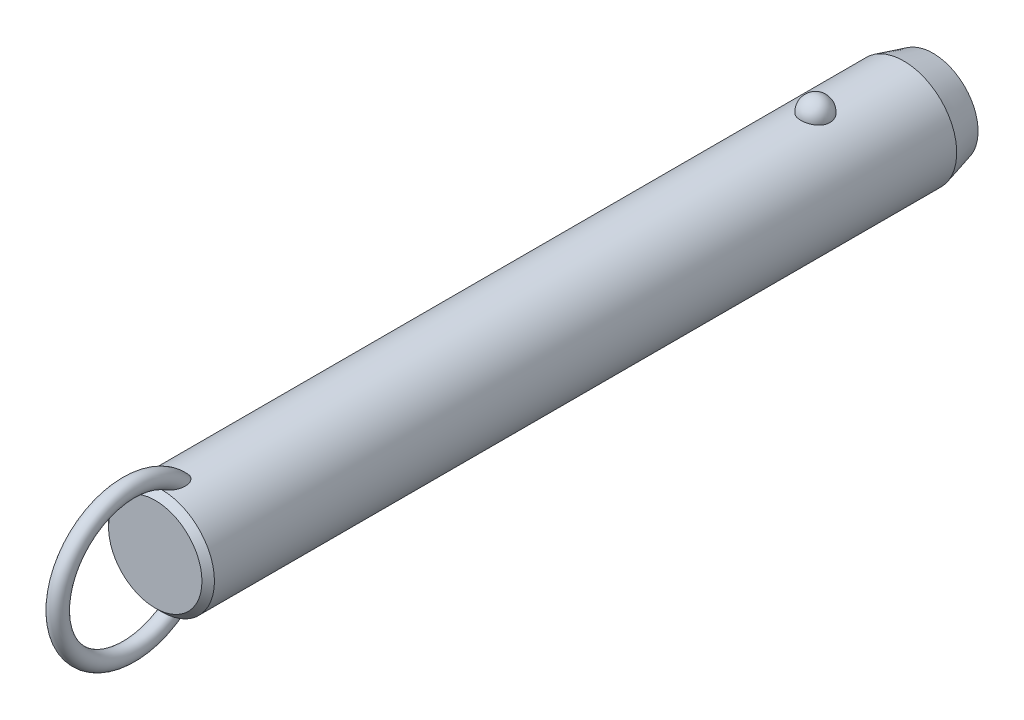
ISO-10303-21;
HEADER;
FILE_DESCRIPTION(('STEP AP214'),'2;1');
FILE_NAME('part.step','',(''),(''),'','','');
FILE_SCHEMA(('AUTOMOTIVE_DESIGN { 1 0 10303 214 1 1 1 1 }'));
ENDSEC;
DATA;
#1=APPLICATION_CONTEXT('core data for automotive mechanical design processes');
#2=APPLICATION_PROTOCOL_DEFINITION('international standard','automotive_design',2000,#1);
#3=PRODUCT_CONTEXT('',#1,'mechanical');
#4=PRODUCT('Part','Part','',(#3));
#5=PRODUCT_RELATED_PRODUCT_CATEGORY('part','',(#4));
#6=PRODUCT_DEFINITION_FORMATION('','',#4);
#7=PRODUCT_DEFINITION_CONTEXT('part definition',#1,'design');
#8=PRODUCT_DEFINITION('design','',#6,#7);
#9=PRODUCT_DEFINITION_SHAPE('','',#8);
#10=(LENGTH_UNIT() NAMED_UNIT(*) SI_UNIT(.MILLI.,.METRE.));
#11=(NAMED_UNIT(*) PLANE_ANGLE_UNIT() SI_UNIT($,.RADIAN.));
#12=(NAMED_UNIT(*) SI_UNIT($,.STERADIAN.) SOLID_ANGLE_UNIT());
#13=UNCERTAINTY_MEASURE_WITH_UNIT(LENGTH_MEASURE(1.E-05),#10,'distance_accuracy_value','');
#14=(GEOMETRIC_REPRESENTATION_CONTEXT(3) GLOBAL_UNCERTAINTY_ASSIGNED_CONTEXT((#13)) GLOBAL_UNIT_ASSIGNED_CONTEXT((#10,
#11,#12)) REPRESENTATION_CONTEXT('',''));
#15=CARTESIAN_POINT('',(0.,0.,0.));
#16=DIRECTION('',(0.,0.,1.));
#17=DIRECTION('',(1.,0.,0.));
#18=AXIS2_PLACEMENT_3D('',#15,#16,#17);
#19=CARTESIAN_POINT('',(0.,0.,142.2));
#20=DIRECTION('',(0.,0.,-1.));
#21=DIRECTION('',(-1.,0.,0.));
#22=AXIS2_PLACEMENT_3D('',#19,#20,#21);
#23=CYLINDRICAL_SURFACE('',#22,12.7);
#24=CARTESIAN_POINT('',(3.46661256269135,12.2177165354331,-3.5));
#25=CARTESIAN_POINT('',(3.4666090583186,12.2177194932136,-3.30432790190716));
#26=CARTESIAN_POINT('',(3.45063567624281,12.2222841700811,-3.10861112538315));
#27=CARTESIAN_POINT('',(3.38712451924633,12.2400345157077,-2.72271899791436));
#28=CARTESIAN_POINT('',(3.33957415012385,12.2532236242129,-2.53254588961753));
#29=CARTESIAN_POINT('',(3.2141234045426,12.286724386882,-2.16324948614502));
#30=CARTESIAN_POINT('',(3.13623639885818,12.3070329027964,-1.98412136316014));
#31=CARTESIAN_POINT('',(2.95205930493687,12.3525018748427,-1.64180592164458));
#32=CARTESIAN_POINT('',(2.84577003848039,12.3776621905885,-1.47861814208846));
#33=CARTESIAN_POINT('',(2.60688050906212,12.4301712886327,-1.17190583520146));
#34=CARTESIAN_POINT('',(2.47415697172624,12.4575299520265,-1.02847897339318));
#35=CARTESIAN_POINT('',(2.18615174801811,12.5112810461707,-0.766177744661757));
#36=CARTESIAN_POINT('',(2.03087002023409,12.5376734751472,-0.647303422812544));
#37=CARTESIAN_POINT('',(1.70237334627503,12.5864761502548,-0.437732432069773));
#38=CARTESIAN_POINT('',(1.52920948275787,12.6088972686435,-0.34695830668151));
#39=CARTESIAN_POINT('',(1.16944170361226,12.6473352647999,-0.195750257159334));
#40=CARTESIAN_POINT('',(0.982839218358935,12.663352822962,-0.135313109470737));
#41=CARTESIAN_POINT('',(0.604961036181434,12.6869706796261,-0.0473241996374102));
#42=CARTESIAN_POINT('',(0.413823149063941,12.6947125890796,-0.0192185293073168));
#43=CARTESIAN_POINT('',(0.0293827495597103,12.7014203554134,0.00517254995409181));
#44=CARTESIAN_POINT('',(-0.163919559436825,12.7003870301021,0.00146092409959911));
#45=CARTESIAN_POINT('',(-0.544374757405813,12.689735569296,-0.0373939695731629));
#46=CARTESIAN_POINT('',(-0.731575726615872,12.6802364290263,-0.0721015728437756));
#47=CARTESIAN_POINT('',(-1.09733277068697,12.6538333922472,-0.171364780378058));
#48=CARTESIAN_POINT('',(-1.27588869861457,12.6369293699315,-0.23592089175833));
#49=CARTESIAN_POINT('',(-1.6204698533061,12.5973946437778,-0.393548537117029));
#50=CARTESIAN_POINT('',(-1.78641865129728,12.5747321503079,-0.48677898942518));
#51=CARTESIAN_POINT('',(-2.10030671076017,12.5261316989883,-0.699110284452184));
#52=CARTESIAN_POINT('',(-2.24824419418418,12.5001934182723,-0.818213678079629));
#53=CARTESIAN_POINT('',(-2.52491489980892,12.4472906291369,-1.08157124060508));
#54=CARTESIAN_POINT('',(-2.65324222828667,12.4203160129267,-1.22624992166));
#55=CARTESIAN_POINT('',(-2.88410007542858,12.3687509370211,-1.53528325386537));
#56=CARTESIAN_POINT('',(-2.98662883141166,12.3441606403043,-1.69963924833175));
#57=CARTESIAN_POINT('',(-3.16432417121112,12.2998199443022,-2.04548497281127));
#58=CARTESIAN_POINT('',(-3.23917525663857,12.2801261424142,-2.22714424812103));
#59=CARTESIAN_POINT('',(-3.35800573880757,12.248167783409,-2.6009138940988));
#60=CARTESIAN_POINT('',(-3.4019860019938,12.2359030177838,-2.79302397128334));
#61=CARTESIAN_POINT('',(-3.45784812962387,12.2202347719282,-3.18140279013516));
#62=CARTESIAN_POINT('',(-3.46986123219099,12.2167950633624,-3.37765118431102));
#63=CARTESIAN_POINT('',(-3.46186273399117,12.2190638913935,-3.76943689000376));
#64=CARTESIAN_POINT('',(-3.44185196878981,12.2247721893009,-3.96497421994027));
#65=CARTESIAN_POINT('',(-3.37048652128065,12.2446381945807,-4.34881728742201));
#66=CARTESIAN_POINT('',(-3.31928253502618,12.2587552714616,-4.53715319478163));
#67=CARTESIAN_POINT('',(-3.18693461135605,12.2938237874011,-4.90231727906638));
#68=CARTESIAN_POINT('',(-3.1057895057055,12.3147754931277,-5.07914500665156));
#69=CARTESIAN_POINT('',(-2.91506431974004,12.3613125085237,-5.4173205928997));
#70=CARTESIAN_POINT('',(-2.80533587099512,12.3869217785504,-5.57858147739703));
#71=CARTESIAN_POINT('',(-2.560414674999,12.4398525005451,-5.88013283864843));
#72=CARTESIAN_POINT('',(-2.42522099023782,12.4671740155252,-6.02042254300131));
#73=CARTESIAN_POINT('',(-2.1323357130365,12.5205965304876,-6.27662798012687));
#74=CARTESIAN_POINT('',(-1.97456596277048,12.5466928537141,-6.39245542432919));
#75=CARTESIAN_POINT('',(-1.64115839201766,12.5946384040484,-6.59583547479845));
#76=CARTESIAN_POINT('',(-1.46552179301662,12.6164879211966,-6.68339001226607));
#77=CARTESIAN_POINT('',(-1.10356050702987,12.6532533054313,-6.82682153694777));
#78=CARTESIAN_POINT('',(-0.917391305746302,12.6682500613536,-6.88306988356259));
#79=CARTESIAN_POINT('',(-0.537836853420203,12.6900288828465,-6.96386887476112));
#80=CARTESIAN_POINT('',(-0.344452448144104,12.6968119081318,-6.9884232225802));
#81=CARTESIAN_POINT('',(0.0402577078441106,12.7013667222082,-7.00496469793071));
#82=CARTESIAN_POINT('',(0.231556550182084,12.6993008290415,-6.99753844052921));
#83=CARTESIAN_POINT('',(0.610105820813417,12.6867505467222,-6.95166366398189));
#84=CARTESIAN_POINT('',(0.797356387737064,12.6762664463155,-6.91321620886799));
#85=CARTESIAN_POINT('',(1.16186657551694,12.6480587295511,-6.80658431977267));
#86=CARTESIAN_POINT('',(1.33915951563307,12.6303611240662,-6.73850666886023));
#87=CARTESIAN_POINT('',(1.67968518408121,12.5896027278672,-6.57450875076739));
#88=CARTESIAN_POINT('',(1.84291705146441,12.5665416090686,-6.47858678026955));
#89=CARTESIAN_POINT('',(2.15340192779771,12.5171072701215,-6.25982455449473));
#90=CARTESIAN_POINT('',(2.30037831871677,12.4906895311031,-6.13660186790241));
#91=CARTESIAN_POINT('',(2.5717412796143,12.4376567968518,-5.86739587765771));
#92=CARTESIAN_POINT('',(2.69612388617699,12.4110417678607,-5.72140858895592));
#93=CARTESIAN_POINT('',(2.92107785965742,12.360051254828,-5.40794137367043));
#94=CARTESIAN_POINT('',(3.02121329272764,12.3357209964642,-5.24014110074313));
#95=CARTESIAN_POINT('',(3.19236291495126,12.2925446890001,-4.8896986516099));
#96=CARTESIAN_POINT('',(3.26338839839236,12.2736965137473,-4.70706226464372));
#97=CARTESIAN_POINT('',(3.36788038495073,12.245404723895,-4.35469510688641));
#98=CARTESIAN_POINT('',(3.40484026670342,12.2351018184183,-4.18605935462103));
#99=CARTESIAN_POINT('',(3.45420764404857,12.2212564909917,-3.84496058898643));
#100=CARTESIAN_POINT('',(3.46661565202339,12.2177139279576,-3.67249765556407));
#101=CARTESIAN_POINT('',(3.46661256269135,12.2177165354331,-3.5));
#102=B_SPLINE_CURVE_WITH_KNOTS('',3,(#24,#25,#26,#27,#28,#29,#30,#31,#32,#33,#34,#35,#36,#37,
#38,#39,#40,#41,#42,#43,#44,#45,#46,#47,#48,#49,#50,#51,#52,#53,#54,#55,#56,#57,#58,#59,#60,#61,
#62,#63,#64,#65,#66,#67,#68,#69,#70,#71,#72,#73,#74,#75,#76,#77,#78,#79,#80,#81,#82,#83,#84,#85,
#86,#87,#88,#89,#90,#91,#92,#93,#94,#95,#96,#97,#98,#99,#100,#101),.UNSPECIFIED.,.T.,.F.,(4,2,2,
2,2,2,2,2,2,2,2,2,2,2,2,2,2,2,2,2,2,2,2,2,2,2,2,2,2,2,2,2,2,2,2,2,2,2,4),(0.,0.586396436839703,
1.17302689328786,1.7593990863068,2.34575431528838,2.93491084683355,3.52406845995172,
4.1115873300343,4.69904375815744,5.2762784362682,5.85345931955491,6.42265312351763,
6.99185659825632,7.56427334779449,8.136746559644,8.71981013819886,9.3029135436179,
9.89247258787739,10.4820150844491,11.0691335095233,11.6562366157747,12.2405256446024,
12.8248374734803,13.412244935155,13.9996740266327,14.5891883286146,15.1786623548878,
15.7609861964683,16.3432419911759,16.914863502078,17.4864654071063,18.056024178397,
18.6256177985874,19.2037609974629,19.7820055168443,20.3699810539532,20.9577282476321,
21.4746855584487,21.9916320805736),.UNSPECIFIED.);
#103=CARTESIAN_POINT('',(3.46661256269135,12.2177165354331,-3.5));
#104=VERTEX_POINT('',#103);
#105=EDGE_CURVE('E41',#104,#104,#102,.T.);
#106=ORIENTED_EDGE('',*,*,#105,.T.);
#107=EDGE_LOOP('',(#106));
#108=FACE_BOUND('',#107,.T.);
#109=CARTESIAN_POINT('',(0.,0.,153.4));
#110=DIRECTION('',(0.,0.,1.));
#111=DIRECTION('',(1.,0.,0.));
#112=AXIS2_PLACEMENT_3D('',#109,#110,#111);
#113=CIRCLE('',#112,12.7);
#114=CARTESIAN_POINT('',(12.7,0.,153.4));
#115=VERTEX_POINT('',#114);
#116=EDGE_CURVE('E10',#115,#115,#113,.F.);
#117=ORIENTED_EDGE('',*,*,#116,.T.);
#118=EDGE_LOOP('',(#117));
#119=FACE_BOUND('',#118,.T.);
#120=CARTESIAN_POINT('',(-0.548122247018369,-12.6881662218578,147.143218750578));
#121=CARTESIAN_POINT('',(-0.648865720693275,-12.6838128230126,147.177926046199));
#122=CARTESIAN_POINT('',(-0.746398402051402,-12.6783867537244,147.222042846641));
#123=CARTESIAN_POINT('',(-0.932125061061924,-12.666091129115,147.326764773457));
#124=CARTESIAN_POINT('',(-1.02030388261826,-12.6592192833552,147.387396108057));
#125=CARTESIAN_POINT('',(-1.18487740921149,-12.6448747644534,147.521847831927));
#126=CARTESIAN_POINT('',(-1.26134296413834,-12.637406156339,147.595582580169));
#127=CARTESIAN_POINT('',(-1.40231200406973,-12.6225412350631,147.753604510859));
#128=CARTESIAN_POINT('',(-1.46681470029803,-12.6151449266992,147.83789238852));
#129=CARTESIAN_POINT('',(-1.60714786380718,-12.5981718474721,148.049657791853));
#130=CARTESIAN_POINT('',(-1.67725126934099,-12.588900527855,148.180962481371));
#131=CARTESIAN_POINT('',(-1.79536591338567,-12.5725964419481,148.453247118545));
#132=CARTESIAN_POINT('',(-1.84333535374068,-12.5655679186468,148.594244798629));
#133=CARTESIAN_POINT('',(-1.93422576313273,-12.5519624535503,148.937645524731));
#134=CARTESIAN_POINT('',(-1.96788773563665,-12.5466298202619,149.142557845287));
#135=CARTESIAN_POINT('',(-1.99413993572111,-12.542463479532,149.451760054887));
#136=CARTESIAN_POINT('',(-1.99883864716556,-12.5417153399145,149.555298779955));
#137=CARTESIAN_POINT('',(-2.00078003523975,-12.5414074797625,149.76245124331));
#138=CARTESIAN_POINT('',(-1.99802449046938,-12.5418474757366,149.866064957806));
#139=CARTESIAN_POINT('',(-1.98336733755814,-12.5441750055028,150.110320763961));
#140=CARTESIAN_POINT('',(-1.96851430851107,-12.5465291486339,150.250780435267));
#141=CARTESIAN_POINT('',(-1.92707089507,-12.5529612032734,150.529960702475));
#142=CARTESIAN_POINT('',(-1.90047458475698,-12.5570399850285,150.668680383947));
#143=CARTESIAN_POINT('',(-1.83619120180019,-12.5666008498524,150.94341135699));
#144=CARTESIAN_POINT('',(-1.79850828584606,-12.57208240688,151.079423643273));
#145=CARTESIAN_POINT('',(-1.7122379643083,-12.5841228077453,151.347842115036));
#146=CARTESIAN_POINT('',(-1.66365679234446,-12.5906810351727,151.480250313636));
#147=CARTESIAN_POINT('',(-1.57804503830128,-12.6016176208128,151.68548877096));
#148=CARTESIAN_POINT('',(-1.5447725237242,-12.6057501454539,151.759914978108));
#149=CARTESIAN_POINT('',(-1.47424480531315,-12.6141930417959,151.906839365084));
#150=CARTESIAN_POINT('',(-1.43699041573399,-12.6185033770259,151.979337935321));
#151=CARTESIAN_POINT('',(-1.35825795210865,-12.6272207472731,152.121892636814));
#152=CARTESIAN_POINT('',(-1.31678520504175,-12.6316276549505,152.191951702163));
#153=CARTESIAN_POINT('',(-1.22917793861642,-12.6404532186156,152.329070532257));
#154=CARTESIAN_POINT('',(-1.18304514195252,-12.6448718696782,152.396131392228));
#155=CARTESIAN_POINT('',(-1.07246411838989,-12.6547893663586,152.543874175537));
#156=CARTESIAN_POINT('',(-1.00642239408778,-12.6602600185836,152.623384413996));
#157=CARTESIAN_POINT('',(-0.864441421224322,-12.6707460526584,152.773169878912));
#158=CARTESIAN_POINT('',(-0.78851691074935,-12.6757620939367,152.843458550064));
#159=CARTESIAN_POINT('',(-0.652215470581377,-12.6833591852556,152.948680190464));
#160=CARTESIAN_POINT('',(-0.594982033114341,-12.6861973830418,152.987624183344));
#161=CARTESIAN_POINT('',(-0.475269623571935,-12.6912445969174,153.056489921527));
#162=CARTESIAN_POINT('',(-0.41280013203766,-12.6934547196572,153.086427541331));
#163=CARTESIAN_POINT('',(-0.295749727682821,-12.6966636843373,153.129756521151));
#164=CARTESIAN_POINT('',(-0.241949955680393,-12.6978134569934,153.145218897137));
#165=CARTESIAN_POINT('',(-0.132508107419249,-12.6994261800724,153.166884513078));
#166=CARTESIAN_POINT('',(-0.0768679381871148,-12.6998898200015,153.173097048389));
#167=CARTESIAN_POINT('',(0.0347696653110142,-12.7000752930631,153.175583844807));
#168=CARTESIAN_POINT('',(0.0907676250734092,-12.6997954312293,153.171835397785));
#169=CARTESIAN_POINT('',(0.201283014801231,-12.6985255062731,153.154788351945));
#170=CARTESIAN_POINT('',(0.255799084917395,-12.6975348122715,153.141481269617));
#171=CARTESIAN_POINT('',(0.376042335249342,-12.6946091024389,153.10203792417));
#172=CARTESIAN_POINT('',(0.440950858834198,-12.6924943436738,153.073449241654));
#173=CARTESIAN_POINT('',(0.565350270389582,-12.6875639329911,153.006323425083));
#174=CARTESIAN_POINT('',(0.624828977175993,-12.6847467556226,152.967764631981));
#175=CARTESIAN_POINT('',(0.774116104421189,-12.6767252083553,152.856949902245));
#176=CARTESIAN_POINT('',(0.859449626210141,-12.6711344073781,152.778760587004));
#177=CARTESIAN_POINT('',(1.01789440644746,-12.6593922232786,152.610943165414));
#178=CARTESIAN_POINT('',(1.09096902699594,-12.653239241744,152.521282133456));
#179=CARTESIAN_POINT('',(1.22268793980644,-12.6411674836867,152.340265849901));
#180=CARTESIAN_POINT('',(1.28193986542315,-12.6352572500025,152.249345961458));
#181=CARTESIAN_POINT('',(1.39259777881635,-12.6235401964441,152.062792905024));
#182=CARTESIAN_POINT('',(1.44399707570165,-12.6177334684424,151.967155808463));
#183=CARTESIAN_POINT('',(1.53972870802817,-12.6064093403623,151.772273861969));
#184=CARTESIAN_POINT('',(1.58405262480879,-12.6008922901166,151.673024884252));
#185=CARTESIAN_POINT('',(1.66600705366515,-12.5903187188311,151.471772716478));
#186=CARTESIAN_POINT('',(1.70363651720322,-12.5852622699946,151.369769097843));
#187=CARTESIAN_POINT('',(1.7754537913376,-12.5753406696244,151.154358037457));
#188=CARTESIAN_POINT('',(1.80903453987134,-12.5705328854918,151.040745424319));
#189=CARTESIAN_POINT('',(1.86844163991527,-12.5618400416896,150.811457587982));
#190=CARTESIAN_POINT('',(1.89426665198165,-12.5579551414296,150.695782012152));
#191=CARTESIAN_POINT('',(1.93785464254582,-12.5513030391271,150.463007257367));
#192=CARTESIAN_POINT('',(1.95562640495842,-12.5485346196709,150.345909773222));
#193=CARTESIAN_POINT('',(1.98264463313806,-12.5442934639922,150.110747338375));
#194=CARTESIAN_POINT('',(1.99189298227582,-12.5428204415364,149.99268260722));
#195=CARTESIAN_POINT('',(2.00416068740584,-12.540871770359,149.680622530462));
#196=CARTESIAN_POINT('',(1.99944433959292,-12.541631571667,149.486229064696));
#197=CARTESIAN_POINT('',(1.9611375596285,-12.5476846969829,149.100309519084));
#198=CARTESIAN_POINT('',(1.92758341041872,-12.5529723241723,148.908780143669));
#199=CARTESIAN_POINT('',(1.83934342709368,-12.5661532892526,148.582272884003));
#200=CARTESIAN_POINT('',(1.79215440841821,-12.5730485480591,148.44524997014));
#201=CARTESIAN_POINT('',(1.67676242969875,-12.588958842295,148.180445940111));
#202=CARTESIAN_POINT('',(1.6085905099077,-12.597970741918,148.052651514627));
#203=CARTESIAN_POINT('',(1.46583832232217,-12.6152829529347,147.835800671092));
#204=CARTESIAN_POINT('',(1.39525727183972,-12.6233659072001,147.74410500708));
#205=CARTESIAN_POINT('',(1.23992594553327,-12.6395676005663,147.573485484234));
#206=CARTESIAN_POINT('',(1.15517932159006,-12.6476863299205,147.494558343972));
#207=CARTESIAN_POINT('',(0.971995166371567,-12.6630846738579,147.352643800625));
#208=CARTESIAN_POINT('',(0.873456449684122,-12.6703572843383,147.289784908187));
#209=CARTESIAN_POINT('',(0.6658477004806,-12.6829569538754,147.184487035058));
#210=CARTESIAN_POINT('',(0.556784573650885,-12.688285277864,147.142034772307));
#211=CARTESIAN_POINT('',(0.347338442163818,-12.6956226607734,147.084443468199));
#212=CARTESIAN_POINT('',(0.247759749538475,-12.6979816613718,147.066399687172));
#213=CARTESIAN_POINT('',(0.047021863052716,-12.7003077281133,147.048600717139));
#214=CARTESIAN_POINT('',(-0.0541350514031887,-12.7002779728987,147.048821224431));
#215=CARTESIAN_POINT('',(-0.22141402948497,-12.6982482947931,147.064363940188));
#216=CARTESIAN_POINT('',(-0.288055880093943,-12.6969033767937,147.074666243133));
#217=CARTESIAN_POINT('',(-0.419599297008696,-12.6932369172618,147.10313489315));
#218=CARTESIAN_POINT('',(-0.484501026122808,-12.6909154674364,147.121300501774));
#219=CARTESIAN_POINT('',(-0.548122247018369,-12.6881662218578,147.143218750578));
#220=B_SPLINE_CURVE_WITH_KNOTS('',3,(#120,#121,#122,#123,#124,#125,#126,#127,#128,#129,#130,
#131,#132,#133,#134,#135,#136,#137,#138,#139,#140,#141,#142,#143,#144,#145,#146,#147,#148,#149,
#150,#151,#152,#153,#154,#155,#156,#157,#158,#159,#160,#161,#162,#163,#164,#165,#166,#167,#168,
#169,#170,#171,#172,#173,#174,#175,#176,#177,#178,#179,#180,#181,#182,#183,#184,#185,#186,#187,
#188,#189,#190,#191,#192,#193,#194,#195,#196,#197,#198,#199,#200,#201,#202,#203,#204,#205,#206,
#207,#208,#209,#210,#211,#212,#213,#214,#215,#216,#217,#218,#219),.UNSPECIFIED.,.T.,.F.,(4,2,2,
2,2,2,2,2,2,2,2,2,2,2,2,2,2,2,2,2,2,2,2,2,2,2,2,2,2,2,2,2,2,2,2,2,2,2,2,2,2,2,2,2,2,2,2,2,2,4),
(0.,0.319642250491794,0.639794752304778,0.957927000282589,1.27608021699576,1.72100165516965,
2.16675988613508,2.78630021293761,3.09705782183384,3.4077412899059,3.83096358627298,
4.25439969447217,4.67767724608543,5.1007133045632,5.34550297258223,5.59024267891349,
5.83467707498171,6.07902143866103,6.38891080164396,6.6983432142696,6.90560910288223,
7.11250749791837,7.279773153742,7.44687060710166,7.6143493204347,7.78197685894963,
7.99365544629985,8.20579780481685,8.551473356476,8.89816429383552,9.22375138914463,
9.54961437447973,9.87586224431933,10.202161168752,10.5575872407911,10.9130746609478,
11.2681734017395,11.6231936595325,12.2046601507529,12.7853961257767,13.2191642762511,
13.6522938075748,13.9989174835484,14.3454519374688,14.6946768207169,15.0436740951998,
15.3457513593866,15.6474266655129,15.8493051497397,16.0511646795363),.UNSPECIFIED.);
#221=CARTESIAN_POINT('',(-0.548122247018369,-12.6881662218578,147.143218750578));
#222=VERTEX_POINT('',#221);
#223=EDGE_CURVE('E59',#222,#222,#220,.T.);
#224=ORIENTED_EDGE('',*,*,#223,.T.);
#225=EDGE_LOOP('',(#224));
#226=FACE_BOUND('',#225,.T.);
#227=CARTESIAN_POINT('',(-0.548122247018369,12.6881662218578,147.143218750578));
#228=CARTESIAN_POINT('',(-0.459436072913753,12.6919968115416,147.112673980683));
#229=CARTESIAN_POINT('',(-0.368189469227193,12.6949996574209,147.089391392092));
#230=CARTESIAN_POINT('',(-0.183024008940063,12.6990186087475,147.058406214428));
#231=CARTESIAN_POINT('',(-0.0891049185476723,12.7000345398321,147.050704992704));
#232=CARTESIAN_POINT('',(0.0987147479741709,12.6999636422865,147.051245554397));
#233=CARTESIAN_POINT('',(0.192615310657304,12.6988761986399,147.059492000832));
#234=CARTESIAN_POINT('',(0.377658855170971,12.6947211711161,147.091551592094));
#235=CARTESIAN_POINT('',(0.468801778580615,12.6916535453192,147.115365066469));
#236=CARTESIAN_POINT('',(0.645809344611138,12.6838788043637,147.17745651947));
#237=CARTESIAN_POINT('',(0.731679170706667,12.6791733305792,147.215720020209));
#238=CARTESIAN_POINT('',(0.896315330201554,12.6686004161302,147.305120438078));
#239=CARTESIAN_POINT('',(0.97508059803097,12.6627328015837,147.356259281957));
#240=CARTESIAN_POINT('',(1.12963655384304,12.6499161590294,147.47367820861));
#241=CARTESIAN_POINT('',(1.20478673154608,12.6429194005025,147.540792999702));
#242=CARTESIAN_POINT('',(1.34448241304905,12.6288282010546,147.68522507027));
#243=CARTESIAN_POINT('',(1.40902173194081,12.621733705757,147.762548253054));
#244=CARTESIAN_POINT('',(1.55208211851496,12.6050877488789,147.959247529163));
#245=CARTESIAN_POINT('',(1.62510490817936,12.5957546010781,148.082654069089));
#246=CARTESIAN_POINT('',(1.7501904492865,12.5789823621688,148.339769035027));
#247=CARTESIAN_POINT('',(1.80221377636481,12.5715468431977,148.473496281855));
#248=CARTESIAN_POINT('',(1.90309965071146,12.5567434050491,148.798351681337));
#249=CARTESIAN_POINT('',(1.94342317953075,12.5504515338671,148.992161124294));
#250=CARTESIAN_POINT('',(1.99332997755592,12.5426147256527,149.38378810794));
#251=CARTESIAN_POINT('',(2.00285305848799,12.5410790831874,149.581612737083));
#252=CARTESIAN_POINT('',(1.99678999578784,12.5420407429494,149.916642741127));
#253=CARTESIAN_POINT('',(1.98794117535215,12.5434564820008,150.054042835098));
#254=CARTESIAN_POINT('',(1.95865119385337,12.5480641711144,150.327639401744));
#255=CARTESIAN_POINT('',(1.9382043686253,12.5512569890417,150.463835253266));
#256=CARTESIAN_POINT('',(1.88647896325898,12.5591352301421,150.734249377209));
#257=CARTESIAN_POINT('',(1.85518800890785,12.5638223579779,150.868465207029));
#258=CARTESIAN_POINT('',(1.78217886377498,12.5743868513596,151.133936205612));
#259=CARTESIAN_POINT('',(1.74046509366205,12.5802637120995,151.265192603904));
#260=CARTESIAN_POINT('',(1.66024095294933,12.5910571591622,151.486085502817));
#261=CARTESIAN_POINT('',(1.62434772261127,12.5957535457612,151.576690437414));
#262=CARTESIAN_POINT('',(1.54709009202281,12.6054762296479,151.755512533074));
#263=CARTESIAN_POINT('',(1.50572681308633,12.6105024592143,151.843730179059));
#264=CARTESIAN_POINT('',(1.41728020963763,12.620748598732,152.016932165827));
#265=CARTESIAN_POINT('',(1.37021377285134,12.625967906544,152.101925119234));
#266=CARTESIAN_POINT('',(1.26969620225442,12.6364721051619,152.268007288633));
#267=CARTESIAN_POINT('',(1.21624929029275,12.6417569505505,152.349099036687));
#268=CARTESIAN_POINT('',(1.1030441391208,12.6521331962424,152.504702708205));
#269=CARTESIAN_POINT('',(1.04340936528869,12.657226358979,152.579303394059));
#270=CARTESIAN_POINT('',(0.915919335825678,12.6670906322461,152.721324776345));
#271=CARTESIAN_POINT('',(0.848064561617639,12.6718617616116,152.788745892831));
#272=CARTESIAN_POINT('',(0.71703570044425,12.67987711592,152.900624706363));
#273=CARTESIAN_POINT('',(0.655526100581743,12.6832377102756,152.946997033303));
#274=CARTESIAN_POINT('',(0.525985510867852,12.6892676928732,153.029619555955));
#275=CARTESIAN_POINT('',(0.457969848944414,12.6919386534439,153.065892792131));
#276=CARTESIAN_POINT('',(0.334859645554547,12.695691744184,153.116657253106));
#277=CARTESIAN_POINT('',(0.281116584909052,12.6970073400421,153.134373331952));
#278=CARTESIAN_POINT('',(0.171425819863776,12.6989609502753,153.160642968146));
#279=CARTESIAN_POINT('',(0.115480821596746,12.699599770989,153.169207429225));
#280=CARTESIAN_POINT('',(0.00272618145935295,12.7001251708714,153.176253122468));
#281=CARTESIAN_POINT('',(-0.0540859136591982,12.7000089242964,153.174696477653));
#282=CARTESIAN_POINT('',(-0.166544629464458,12.6990328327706,153.161600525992));
#283=CARTESIAN_POINT('',(-0.222190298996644,12.6981724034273,153.150053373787));
#284=CARTESIAN_POINT('',(-0.342018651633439,12.695562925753,153.114912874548));
#285=CARTESIAN_POINT('',(-0.40560689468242,12.6936676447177,153.08933225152));
#286=CARTESIAN_POINT('',(-0.5278154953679,12.6891754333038,153.028311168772));
#287=CARTESIAN_POINT('',(-0.586425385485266,12.6865770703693,152.992850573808));
#288=CARTESIAN_POINT('',(-0.731842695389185,12.6792129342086,152.891496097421));
#289=CARTESIAN_POINT('',(-0.814709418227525,12.6740767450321,152.8200395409));
#290=CARTESIAN_POINT('',(-0.969101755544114,12.6632083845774,152.66589007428));
#291=CARTESIAN_POINT('',(-1.04059564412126,12.6574746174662,152.583166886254));
#292=CARTESIAN_POINT('',(-1.16981116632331,12.6461638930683,152.415809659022));
#293=CARTESIAN_POINT('',(-1.22811369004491,12.6405994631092,152.331616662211));
#294=CARTESIAN_POINT('',(-1.33743405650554,12.6295007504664,152.158579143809));
#295=CARTESIAN_POINT('',(-1.38844577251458,12.6239664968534,152.069730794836));
#296=CARTESIAN_POINT('',(-1.48400702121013,12.6130898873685,151.888389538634));
#297=CARTESIAN_POINT('',(-1.5285423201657,12.6077479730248,151.795889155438));
#298=CARTESIAN_POINT('',(-1.61150113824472,12.5974127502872,151.608160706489));
#299=CARTESIAN_POINT('',(-1.64992317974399,12.5924195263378,151.512931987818));
#300=CARTESIAN_POINT('',(-1.73468589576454,12.581070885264,151.28289362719));
#301=CARTESIAN_POINT('',(-1.77831261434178,12.5749388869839,151.147066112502));
#302=CARTESIAN_POINT('',(-1.85439734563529,12.5639437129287,150.872212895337));
#303=CARTESIAN_POINT('',(-1.88684994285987,12.5590811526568,150.733185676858));
#304=CARTESIAN_POINT('',(-1.9400848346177,12.550968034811,150.45309235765));
#305=CARTESIAN_POINT('',(-1.96088706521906,12.5477147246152,150.312030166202));
#306=CARTESIAN_POINT('',(-1.99000539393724,12.5431291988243,150.028668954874));
#307=CARTESIAN_POINT('',(-1.99832911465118,12.5417958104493,149.886370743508));
#308=CARTESIAN_POINT('',(-2.00166624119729,12.5412674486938,149.557627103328));
#309=CARTESIAN_POINT('',(-1.99178843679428,12.5428579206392,149.371088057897));
#310=CARTESIAN_POINT('',(-1.9445518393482,12.5502731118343,149.00162404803));
#311=CARTESIAN_POINT('',(-1.90724032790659,12.5560905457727,148.818693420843));
#312=CARTESIAN_POINT('',(-1.81330718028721,12.5699462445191,148.504848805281));
#313=CARTESIAN_POINT('',(-1.76338820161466,12.5771273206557,148.371910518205));
#314=CARTESIAN_POINT('',(-1.6430501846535,12.593414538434,148.115681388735));
#315=CARTESIAN_POINT('',(-1.57265346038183,12.6025185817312,147.992380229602));
#316=CARTESIAN_POINT('',(-1.42634956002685,12.6198178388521,147.783564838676));
#317=CARTESIAN_POINT('',(-1.35423772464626,12.6278405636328,147.695384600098));
#318=CARTESIAN_POINT('',(-1.19645664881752,12.6437632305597,147.532107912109));
#319=CARTESIAN_POINT('',(-1.11080536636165,12.6516633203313,147.456994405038));
#320=CARTESIAN_POINT('',(-0.947219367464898,12.6648319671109,147.337811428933));
#321=CARTESIAN_POINT('',(-0.871624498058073,12.670300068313,147.290541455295));
#322=CARTESIAN_POINT('',(-0.714161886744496,12.6801492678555,147.2077413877));
#323=CARTESIAN_POINT('',(-0.632295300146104,12.684530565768,147.17220913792));
#324=CARTESIAN_POINT('',(-0.548122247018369,12.6881662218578,147.143218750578));
#325=B_SPLINE_CURVE_WITH_KNOTS('',3,(#227,#228,#229,#230,#231,#232,#233,#234,#235,#236,#237,
#238,#239,#240,#241,#242,#243,#244,#245,#246,#247,#248,#249,#250,#251,#252,#253,#254,#255,#256,
#257,#258,#259,#260,#261,#262,#263,#264,#265,#266,#267,#268,#269,#270,#271,#272,#273,#274,#275,
#276,#277,#278,#279,#280,#281,#282,#283,#284,#285,#286,#287,#288,#289,#290,#291,#292,#293,#294,
#295,#296,#297,#298,#299,#300,#301,#302,#303,#304,#305,#306,#307,#308,#309,#310,#311,#312,#313,
#314,#315,#316,#317,#318,#319,#320,#321,#322,#323,#324),.UNSPECIFIED.,.T.,.F.,(4,2,2,2,2,2,2,2,
2,2,2,2,2,2,2,2,2,2,2,2,2,2,2,2,2,2,2,2,2,2,2,2,2,2,2,2,2,2,2,2,2,2,2,2,2,2,2,2,4),(0.,
0.281328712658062,0.562682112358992,0.844117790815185,1.12555942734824,1.40671982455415,
1.68792232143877,1.98972294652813,2.29169886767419,2.72039860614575,3.14989948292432,
3.74084916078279,4.33295293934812,4.74554109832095,5.15833092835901,5.57159335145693,
5.98468079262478,6.27722775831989,6.5697148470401,6.86135609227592,7.15280542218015,
7.43927407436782,7.72572595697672,7.9563586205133,8.18646071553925,8.35559393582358,
8.52452541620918,8.69408946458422,8.86378678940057,9.06834348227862,9.27332014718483,
9.60010414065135,9.9277843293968,10.2350252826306,10.5425229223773,10.8506864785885,
11.1589244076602,11.5867893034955,12.0148612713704,12.4421984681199,12.8692745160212,
13.4279365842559,13.9856380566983,14.4107062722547,14.8353130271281,15.1765567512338,
15.5173516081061,15.7844129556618,16.051425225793),.UNSPECIFIED.);
#326=CARTESIAN_POINT('',(-0.548122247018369,12.6881662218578,147.143218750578));
#327=VERTEX_POINT('',#326);
#328=EDGE_CURVE('E67',#327,#327,#325,.T.);
#329=ORIENTED_EDGE('',*,*,#328,.T.);
#330=EDGE_LOOP('',(#329));
#331=FACE_BOUND('',#330,.T.);
#332=CARTESIAN_POINT('',(0.,0.,-24.6999999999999));
#333=DIRECTION('',(0.,0.,-1.));
#334=DIRECTION('',(-1.,0.,0.));
#335=AXIS2_PLACEMENT_3D('',#332,#333,#334);
#336=CIRCLE('',#335,12.7);
#337=CARTESIAN_POINT('',(-12.7,0.,-24.6999999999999));
#338=VERTEX_POINT('',#337);
#339=EDGE_CURVE('E56',#338,#338,#336,.F.);
#340=ORIENTED_EDGE('',*,*,#339,.T.);
#341=EDGE_LOOP('',(#340));
#342=FACE_BOUND('',#341,.T.);
#343=ADVANCED_FACE('F37',(#108,#119,#226,#331,#342),#23,.T.);
#344=CARTESIAN_POINT('',(0.,0.,-31.7));
#345=DIRECTION('',(0.,0.,-1.));
#346=DIRECTION('',(-1.,0.,0.));
#347=AXIS2_PLACEMENT_3D('',#344,#345,#346);
#348=PLANE('',#347);
#349=CARTESIAN_POINT('',(0.,0.,-31.7));
#350=DIRECTION('',(0.,0.,-1.));
#351=DIRECTION('',(-1.,0.,0.));
#352=AXIS2_PLACEMENT_3D('',#349,#350,#351);
#353=CIRCLE('',#352,10.8243556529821);
#354=CARTESIAN_POINT('',(-10.8243556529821,0.,-31.7));
#355=VERTEX_POINT('',#354);
#356=EDGE_CURVE('E66',#355,#355,#353,.T.);
#357=ORIENTED_EDGE('',*,*,#356,.T.);
#358=EDGE_LOOP('',(#357));
#359=FACE_BOUND('',#358,.T.);
#360=ADVANCED_FACE('F85',(#359),#348,.T.);
#361=CARTESIAN_POINT('',(0.,0.,-31.7));
#362=DIRECTION('',(0.,0.,1.));
#363=DIRECTION('',(1.,0.,0.));
#364=AXIS2_PLACEMENT_3D('',#361,#362,#363);
#365=CONICAL_SURFACE('',#364,10.8243556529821,0.261799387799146);
#366=ORIENTED_EDGE('',*,*,#339,.F.);
#367=EDGE_LOOP('',(#366));
#368=FACE_BOUND('',#367,.T.);
#369=ORIENTED_EDGE('',*,*,#356,.F.);
#370=EDGE_LOOP('',(#369));
#371=FACE_BOUND('',#370,.T.);
#372=ADVANCED_FACE('F83',(#368,#371),#365,.T.);
#373=CARTESIAN_POINT('',(0.,0.,154.9));
#374=DIRECTION('',(0.,0.,1.));
#375=DIRECTION('',(1.,0.,0.));
#376=AXIS2_PLACEMENT_3D('',#373,#374,#375);
#377=PLANE('',#376);
#378=CARTESIAN_POINT('',(0.,0.,154.9));
#379=DIRECTION('',(0.,0.,1.));
#380=DIRECTION('',(1.,0.,0.));
#381=AXIS2_PLACEMENT_3D('',#378,#379,#380);
#382=CIRCLE('',#381,11.2);
#383=CARTESIAN_POINT('',(11.2,0.,154.9));
#384=VERTEX_POINT('',#383);
#385=EDGE_CURVE('E50',#384,#384,#382,.T.);
#386=ORIENTED_EDGE('',*,*,#385,.T.);
#387=EDGE_LOOP('',(#386));
#388=FACE_BOUND('',#387,.T.);
#389=ADVANCED_FACE('F77',(#388),#377,.T.);
#390=CARTESIAN_POINT('',(0.,0.,161.25));
#391=DIRECTION('',(1.,0.,0.));
#392=DIRECTION('',(0.,0.,-1.));
#393=AXIS2_PLACEMENT_3D('',#390,#391,#392);
#394=TOROIDAL_SURFACE('',#393,17.05,2.);
#395=ORIENTED_EDGE('',*,*,#328,.F.);
#396=EDGE_LOOP('',(#395));
#397=FACE_BOUND('',#396,.T.);
#398=ORIENTED_EDGE('',*,*,#223,.F.);
#399=EDGE_LOOP('',(#398));
#400=FACE_BOUND('',#399,.T.);
#401=ADVANCED_FACE('F73',(#397,#400),#394,.T.);
#402=CARTESIAN_POINT('',(0.,0.,154.9));
#403=DIRECTION('',(0.,0.,-1.));
#404=DIRECTION('',(-1.,0.,0.));
#405=AXIS2_PLACEMENT_3D('',#402,#403,#404);
#406=CONICAL_SURFACE('',#405,11.2,0.785398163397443);
#407=ORIENTED_EDGE('',*,*,#116,.F.);
#408=EDGE_LOOP('',(#407));
#409=FACE_BOUND('',#408,.T.);
#410=ORIENTED_EDGE('',*,*,#385,.F.);
#411=EDGE_LOOP('',(#410));
#412=FACE_BOUND('',#411,.T.);
#413=ADVANCED_FACE('F39',(#409,#412),#406,.T.);
#414=CARTESIAN_POINT('',(0.,12.7,-3.5));
#415=DIRECTION('',(0.,1.,0.));
#416=DIRECTION('',(0.,0.,1.));
#417=AXIS2_PLACEMENT_3D('',#414,#415,#416);
#418=SPHERICAL_SURFACE('',#417,3.5);
#419=ORIENTED_EDGE('',*,*,#105,.F.);
#420=EDGE_LOOP('',(#419));
#421=FACE_BOUND('',#420,.T.);
#422=ADVANCED_FACE('F79',(#421),#418,.T.);
#423=CLOSED_SHELL('',(#343,#360,#372,#389,#401,#413,#422));
#424=MANIFOLD_SOLID_BREP('B2',#423);
#425=ADVANCED_BREP_SHAPE_REPRESENTATION('',(#18,#424),#14);
#426=SHAPE_DEFINITION_REPRESENTATION(#9,#425);
ENDSEC;
END-ISO-10303-21;
